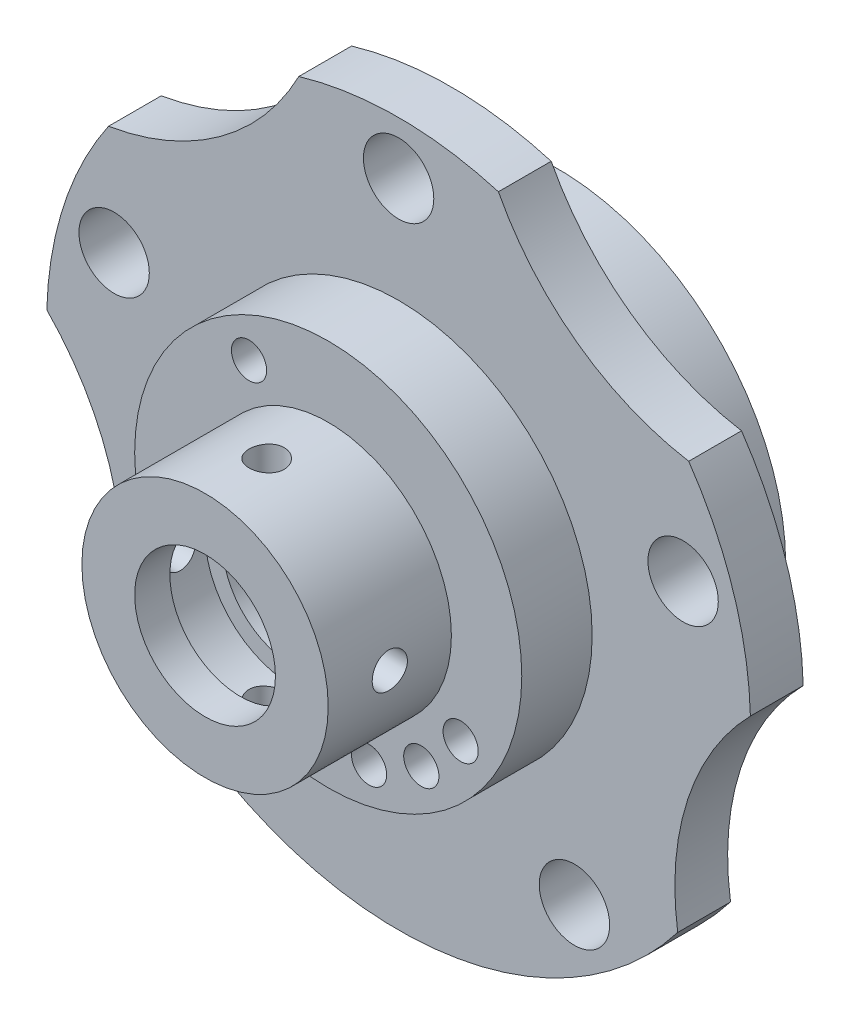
from build123d import *

# Parameters (mm, degrees)
SKETCH_1_R          = 5
SKETCH_1_R_2        = 2
EXTRUDE_1_DEPTH     = 3
SKETCH_2_R          = 11
SKETCH_2_R_2        = 5
EXTRUDE_2_DEPTH     = 4
SKETCH_3_R          = 7
SKETCH_3_R_2        = 4
EXTRUDE_3_DEPTH     = 7
SKETCH_4_W          = 5
SKETCH_4_H          = 3
SKETCH_5_R          = 1
CUT_EXTRUDE_1_DEPTH = 30.132747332
EXTRUDE_START       = 6
SKETCH_6_R          = 13
SKETCH_6_R_2        = 11
EXTRUDE_4_DEPTH     = 6
SKETCH_7_R          = 1
CUT_EXTRUDE_2_DEPTH = 10
SKETCH_8_R          = 1
CUT_EXTRUDE_3_DEPTH = 10


with BuildPart() as part:
    # Sketch 1 → Extrude 1 (new body)
    with BuildSketch(Plane.XY):
        with BuildLine():
            ThreePointArc((19.992922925, 0.532008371), (19.021130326, 6.180339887), (16.487321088, 11.321141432))
            ThreePointArc((16.487321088, 11.321141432), (10.156001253, 13.97853651), (5.672182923, 19.178799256))
            ThreePointArc((5.672182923, 19.178799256), (0, 20), (-5.672182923, 19.178799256))
            ThreePointArc((-5.672182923, 19.178799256), (-10.156001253, 13.97853651), (-16.487321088, 11.321141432))
            ThreePointArc((-16.487321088, 11.321141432), (-19.021130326, 6.180339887), (-19.992922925, 0.532008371))
            ThreePointArc((-19.992922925, 0.532008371), (-16.432755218, -5.339325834), (-15.861907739, -12.181949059))
            ThreePointArc((-15.861907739, -12.181949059), (0, -20), (15.861907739, -12.181949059))
            ThreePointArc((15.861907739, -12.181949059), (16.432755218, -5.339325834), (19.992922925, 0.532008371))
        make_face()
        Circle(SKETCH_1_R, mode=Mode.SUBTRACT)
        with Locations((16.167960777, 5.253288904)):
            Circle(SKETCH_1_R_2, mode=Mode.SUBTRACT)
        with Locations((9.992349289, -13.753288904)):
            Circle(SKETCH_1_R_2, mode=Mode.SUBTRACT)
        with Locations((-9.992349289, -13.753288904)):
            Circle(SKETCH_1_R_2, mode=Mode.SUBTRACT)
        with Locations((-16.167960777, 5.253288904)):
            Circle(SKETCH_1_R_2, mode=Mode.SUBTRACT)
        with Locations((0, 17)):
            Circle(SKETCH_1_R_2, mode=Mode.SUBTRACT)
    extrude(amount=EXTRUDE_1_DEPTH)

    # Sketch 2 → Extrude 2 (add)
    with BuildSketch(Plane.XY.offset(3)):
        Circle(SKETCH_2_R)
        Circle(SKETCH_2_R_2, mode=Mode.SUBTRACT)
    extrude(amount=EXTRUDE_2_DEPTH)

    # Sketch 3 → Extrude 3 (add)
    with BuildSketch(Plane.XY.offset(7)):
        Circle(SKETCH_3_R)
        Circle(SKETCH_3_R_2, mode=Mode.SUBTRACT)
    extrude(amount=EXTRUDE_3_DEPTH)

    # Sketch 4 → Cut-Revolve 1 (revolve, cut)
    with BuildSketch(Plane(origin=(0, 0, 0), x_dir=(1, 0, 0), z_dir=(0, 1, 0))):
        with Locations((-2.5, -10.5)):
            Rectangle(SKETCH_4_W, SKETCH_4_H)
    revolve(axis=Axis((0, 0, 0), (0, 0, 1)), mode=Mode.SUBTRACT)

    # Sketch 5 → Cut-Extrude 1 (cut, through all)
    with BuildSketch(Plane.XY.offset(7)):
        with Locations((-4.5, 7.794228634)):
            Circle(SKETCH_5_R)
        with Locations((5.290067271, -7.281152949)):
            Circle(SKETCH_5_R)
        with Locations((2.32118546, -8.695521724)):
            Circle(SKETCH_5_R)
        with Locations((7.525858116, -4.935732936)):
            Circle(SKETCH_5_R)
    extrude(amount=-CUT_EXTRUDE_1_DEPTH, mode=Mode.SUBTRACT)

    # Sketch 6 → Extrude 4 (add)
    with BuildSketch(Plane(origin=(0, 0, 0), x_dir=(-1, 0, 0), z_dir=(0, 0, -1)).offset(EXTRUDE_START)):
        with Locations(Location((0, 0, 0), (0, 0, 180))):
            Circle(SKETCH_6_R)
        with Locations(Location((0, 0, 0), (0, 0, 180))):
            Circle(SKETCH_6_R_2, mode=Mode.SUBTRACT)
    extrude(amount=-EXTRUDE_4_DEPTH)

    # Sketch 7 → Cut-Extrude 2 (cut, symmetric)
    with BuildSketch(Plane(origin=(0, 0, 0), x_dir=(0, 0, -1), z_dir=(1, 0, 0))):
        with Locations((-10.5, 0)):
            Circle(SKETCH_7_R)
    extrude(amount=CUT_EXTRUDE_2_DEPTH, both=True, mode=Mode.SUBTRACT)

    # Sketch 8 → Cut-Extrude 3 (cut, symmetric)
    with BuildSketch(Plane(origin=(0, 0, 0), x_dir=(1, 0, 0), z_dir=(0, 1, 0))):
        with Locations(Location((0, -10.5, 0), (0, 0, 270))):
            Circle(SKETCH_8_R)
    extrude(amount=CUT_EXTRUDE_3_DEPTH, both=True, mode=Mode.SUBTRACT)


solid = part.part
